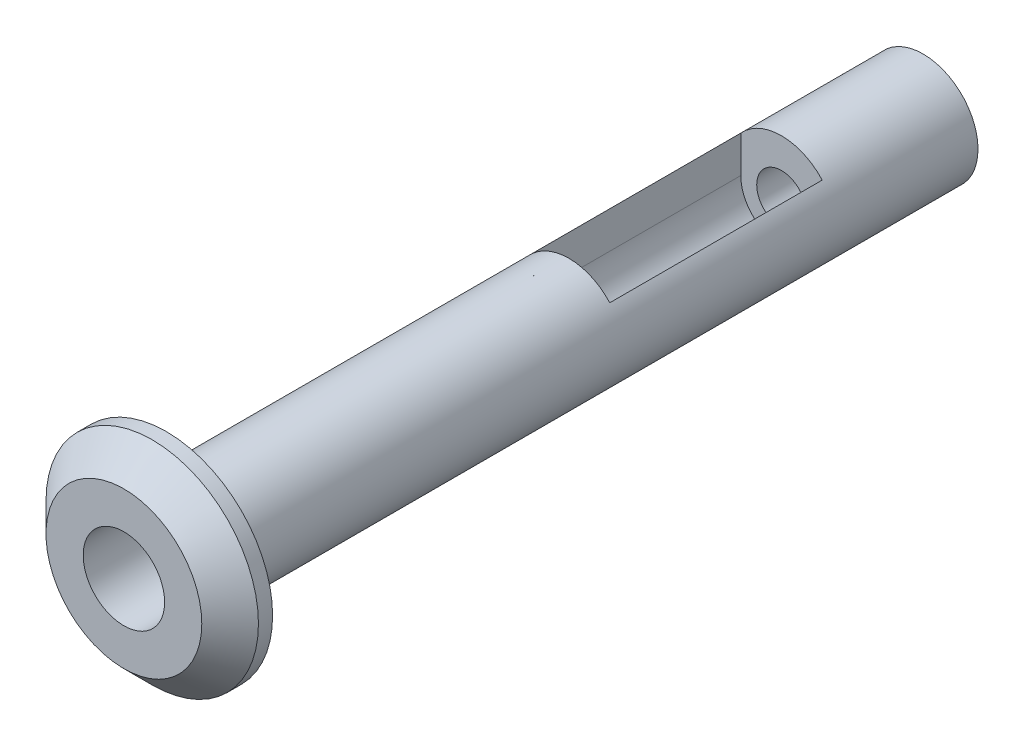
from build123d import *
from build123d.topology import SkipClean

# Parameters (mm, degrees)
CROQUIS1_R              = 7.5
CROQUIS1_R_2            = 1.75
SALIENTE_EXTRUIR1_DEPTH = 1.5
CHAFL_N1_SIZE           = 2
SALIENTE_EXTRUIR2_START = 53.43
CROQUIS2_R              = 3.875
CROQUIS2_R_2            = 1.75
SALIENTE_EXTRUIR2_DEPTH = 53.43
CROQUIS3_R              = 2.875
CORTAR_EXTRUIR1_DEPTH   = 46.43
CORTAR_EXTRUIR2_DEPTH   = 15


with BuildPart() as part:
    # Croquis1 → Saliente-Extruir1 (new, symmetric)
    with BuildSketch(Plane.XY):
        Circle(CROQUIS1_R)
        Circle(CROQUIS1_R_2, mode=Mode.SUBTRACT)
    extrude(amount=SALIENTE_EXTRUIR1_DEPTH, both=True)

    # Chafl_n1
    chafl_n1_edges = [part.edges().sort_by_distance(p)[0] for p in [
        (-7.5, 0, 1.5),
    ]]
    chamfer(chafl_n1_edges, length=CHAFL_N1_SIZE)

    # Croquis2 → Saliente-Extruir2 (add)
    with SkipClean():  # the faces are left unmerged after this step: merging them gives an invalid solid
        with BuildSketch(Plane(origin=(0, 0, -1.5), x_dir=(-1, 0, 0), z_dir=(0, 0, -1)).offset(SALIENTE_EXTRUIR2_START)):
            with Locations(Location((0, 0, 0), (0, 0, 180))):
                Circle(CROQUIS2_R)
            Circle(CROQUIS2_R_2, mode=Mode.SUBTRACT)
        extrude(amount=-SALIENTE_EXTRUIR2_DEPTH)

    # Croquis3 → Cortar-Extruir1 (cut)
    with BuildSketch(Plane.XY.offset(1.5)):
        Circle(CROQUIS3_R)
    extrude(amount=-CORTAR_EXTRUIR1_DEPTH, mode=Mode.SUBTRACT)

    # Croquis4 → Cortar-Extruir2 (cut)
    with BuildSketch(Plane.XY.offset(-44.93)):
        with BuildLine():
            Line((-1.75, 0), (-2.875, 0))
            Line((-2.875, 0), (-2.875, 2.598076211))
            ThreePointArc((-2.875, 2.598076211), (0, 3.875), (2.875, 2.598076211))
            Line((2.875, 2.598076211), (2.875, 0))
            Line((2.875, 0), (1.75, 0))
            ThreePointArc((1.75, 0), (0, 1.75), (-1.75, 0))
        make_face()
    extrude(amount=CORTAR_EXTRUIR2_DEPTH, mode=Mode.SUBTRACT)


solid = part.part
